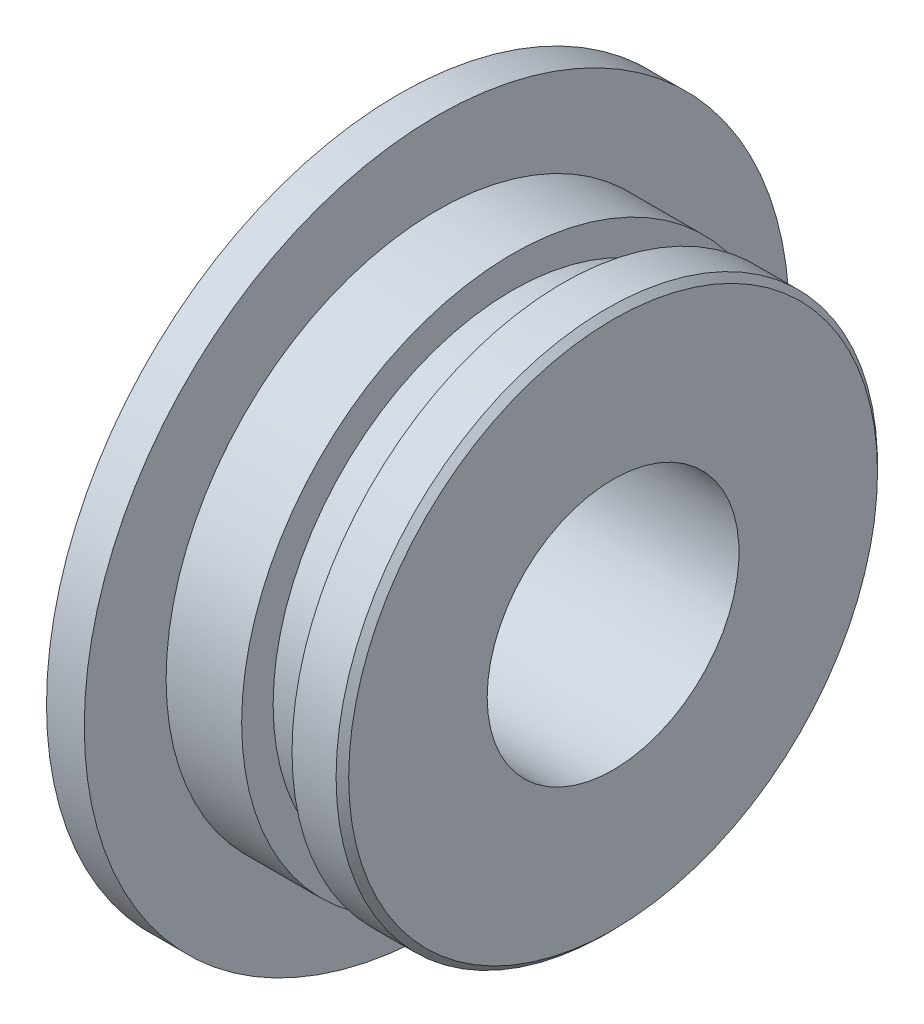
ISO-10303-21;
HEADER;
FILE_DESCRIPTION(('STEP AP214'),'2;1');
FILE_NAME('part.step','',(''),(''),'','','');
FILE_SCHEMA(('AUTOMOTIVE_DESIGN { 1 0 10303 214 1 1 1 1 }'));
ENDSEC;
DATA;
#1=APPLICATION_CONTEXT('core data for automotive mechanical design processes');
#2=APPLICATION_PROTOCOL_DEFINITION('international standard','automotive_design',2000,#1);
#3=PRODUCT_CONTEXT('',#1,'mechanical');
#4=PRODUCT('Part','Part','',(#3));
#5=PRODUCT_RELATED_PRODUCT_CATEGORY('part','',(#4));
#6=PRODUCT_DEFINITION_FORMATION('','',#4);
#7=PRODUCT_DEFINITION_CONTEXT('part definition',#1,'design');
#8=PRODUCT_DEFINITION('design','',#6,#7);
#9=PRODUCT_DEFINITION_SHAPE('','',#8);
#10=(LENGTH_UNIT() NAMED_UNIT(*) SI_UNIT(.MILLI.,.METRE.));
#11=(NAMED_UNIT(*) PLANE_ANGLE_UNIT() SI_UNIT($,.RADIAN.));
#12=(NAMED_UNIT(*) SI_UNIT($,.STERADIAN.) SOLID_ANGLE_UNIT());
#13=UNCERTAINTY_MEASURE_WITH_UNIT(LENGTH_MEASURE(1.E-05),#10,'distance_accuracy_value','');
#14=(GEOMETRIC_REPRESENTATION_CONTEXT(3) GLOBAL_UNCERTAINTY_ASSIGNED_CONTEXT((#13)) GLOBAL_UNIT_ASSIGNED_CONTEXT((#10,
#11,#12)) REPRESENTATION_CONTEXT('',''));
#15=CARTESIAN_POINT('',(0.,0.,0.));
#16=DIRECTION('',(0.,0.,1.));
#17=DIRECTION('',(1.,0.,0.));
#18=AXIS2_PLACEMENT_3D('',#15,#16,#17);
#19=CARTESIAN_POINT('',(0.,0.,0.));
#20=DIRECTION('',(-1.,0.,0.));
#21=DIRECTION('',(0.,0.,1.));
#22=AXIS2_PLACEMENT_3D('',#19,#20,#21);
#23=CYLINDRICAL_SURFACE('',#22,8.4);
#24=CARTESIAN_POINT('',(0.,0.,0.));
#25=DIRECTION('',(-1.,0.,0.));
#26=DIRECTION('',(0.,0.,1.));
#27=AXIS2_PLACEMENT_3D('',#24,#25,#26);
#28=CIRCLE('',#27,8.4);
#29=CARTESIAN_POINT('',(0.,0.,8.4));
#30=VERTEX_POINT('',#29);
#31=EDGE_CURVE('E40',#30,#30,#28,.T.);
#32=ORIENTED_EDGE('',*,*,#31,.F.);
#33=EDGE_LOOP('',(#32));
#34=FACE_BOUND('',#33,.T.);
#35=CARTESIAN_POINT('',(2.4,0.,0.));
#36=DIRECTION('',(-1.,0.,0.));
#37=DIRECTION('',(0.,0.,1.));
#38=AXIS2_PLACEMENT_3D('',#35,#36,#37);
#39=CIRCLE('',#38,8.4);
#40=CARTESIAN_POINT('',(2.4,0.,8.4));
#41=VERTEX_POINT('',#40);
#42=EDGE_CURVE('E73',#41,#41,#39,.T.);
#43=ORIENTED_EDGE('',*,*,#42,.T.);
#44=EDGE_LOOP('',(#43));
#45=FACE_BOUND('',#44,.T.);
#46=ADVANCED_FACE('F29',(#34,#45),#23,.T.);
#47=CARTESIAN_POINT('',(0.,5.,0.));
#48=DIRECTION('',(1.,0.,0.));
#49=DIRECTION('',(0.,0.,-1.));
#50=AXIS2_PLACEMENT_3D('',#47,#48,#49);
#51=PLANE('',#50);
#52=CARTESIAN_POINT('',(0.,0.,0.));
#53=DIRECTION('',(-1.,0.,0.));
#54=DIRECTION('',(0.,0.,1.));
#55=AXIS2_PLACEMENT_3D('',#52,#53,#54);
#56=CIRCLE('',#55,5.);
#57=CARTESIAN_POINT('',(0.,0.,5.));
#58=VERTEX_POINT('',#57);
#59=EDGE_CURVE('E44',#58,#58,#56,.T.);
#60=ORIENTED_EDGE('',*,*,#59,.F.);
#61=EDGE_LOOP('',(#60));
#62=FACE_BOUND('',#61,.T.);
#63=ORIENTED_EDGE('',*,*,#31,.T.);
#64=EDGE_LOOP('',(#63));
#65=FACE_BOUND('',#64,.T.);
#66=ADVANCED_FACE('F130',(#62,#65),#51,.F.);
#67=CARTESIAN_POINT('',(0.,0.,0.));
#68=DIRECTION('',(-1.,0.,0.));
#69=DIRECTION('',(0.,0.,1.));
#70=AXIS2_PLACEMENT_3D('',#67,#68,#69);
#71=CYLINDRICAL_SURFACE('',#70,5.);
#72=CARTESIAN_POINT('',(10.9,0.,0.));
#73=DIRECTION('',(-1.,0.,0.));
#74=DIRECTION('',(0.,0.,1.));
#75=AXIS2_PLACEMENT_3D('',#72,#73,#74);
#76=CIRCLE('',#75,5.);
#77=CARTESIAN_POINT('',(10.9,0.,5.));
#78=VERTEX_POINT('',#77);
#79=EDGE_CURVE('E49',#78,#78,#76,.T.);
#80=ORIENTED_EDGE('',*,*,#79,.F.);
#81=EDGE_LOOP('',(#80));
#82=FACE_BOUND('',#81,.T.);
#83=ORIENTED_EDGE('',*,*,#59,.T.);
#84=EDGE_LOOP('',(#83));
#85=FACE_BOUND('',#84,.T.);
#86=ADVANCED_FACE('F127',(#82,#85),#71,.F.);
#87=CARTESIAN_POINT('',(10.9,10.75,0.));
#88=DIRECTION('',(-1.,0.,0.));
#89=DIRECTION('',(0.,0.,1.));
#90=AXIS2_PLACEMENT_3D('',#87,#88,#89);
#91=PLANE('',#90);
#92=CARTESIAN_POINT('',(10.9,0.,0.));
#93=DIRECTION('',(-1.,0.,0.));
#94=DIRECTION('',(0.,0.,1.));
#95=AXIS2_PLACEMENT_3D('',#92,#93,#94);
#96=CIRCLE('',#95,10.5);
#97=CARTESIAN_POINT('',(10.9,0.,10.5));
#98=VERTEX_POINT('',#97);
#99=EDGE_CURVE('E10',#98,#98,#96,.F.);
#100=ORIENTED_EDGE('',*,*,#99,.T.);
#101=EDGE_LOOP('',(#100));
#102=FACE_BOUND('',#101,.T.);
#103=ORIENTED_EDGE('',*,*,#79,.T.);
#104=EDGE_LOOP('',(#103));
#105=FACE_BOUND('',#104,.T.);
#106=ADVANCED_FACE('F122',(#102,#105),#91,.F.);
#107=CARTESIAN_POINT('',(0.,0.,0.));
#108=DIRECTION('',(-1.,0.,0.));
#109=DIRECTION('',(0.,0.,1.));
#110=AXIS2_PLACEMENT_3D('',#107,#108,#109);
#111=CYLINDRICAL_SURFACE('',#110,10.75);
#112=CARTESIAN_POINT('',(10.65,0.,0.));
#113=DIRECTION('',(-1.,0.,0.));
#114=DIRECTION('',(0.,0.,1.));
#115=AXIS2_PLACEMENT_3D('',#112,#113,#114);
#116=CIRCLE('',#115,10.75);
#117=CARTESIAN_POINT('',(10.65,0.,10.75));
#118=VERTEX_POINT('',#117);
#119=EDGE_CURVE('E36',#118,#118,#116,.T.);
#120=ORIENTED_EDGE('',*,*,#119,.T.);
#121=EDGE_LOOP('',(#120));
#122=FACE_BOUND('',#121,.T.);
#123=CARTESIAN_POINT('',(8.9,0.,0.));
#124=DIRECTION('',(-1.,0.,0.));
#125=DIRECTION('',(0.,0.,1.));
#126=AXIS2_PLACEMENT_3D('',#123,#124,#125);
#127=CIRCLE('',#126,10.75);
#128=CARTESIAN_POINT('',(8.9,0.,10.75));
#129=VERTEX_POINT('',#128);
#130=EDGE_CURVE('E52',#129,#129,#127,.T.);
#131=ORIENTED_EDGE('',*,*,#130,.F.);
#132=EDGE_LOOP('',(#131));
#133=FACE_BOUND('',#132,.T.);
#134=ADVANCED_FACE('F117',(#122,#133),#111,.T.);
#135=CARTESIAN_POINT('',(8.9,9.50000000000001,0.));
#136=DIRECTION('',(1.,0.,0.));
#137=DIRECTION('',(0.,0.,-1.));
#138=AXIS2_PLACEMENT_3D('',#135,#136,#137);
#139=PLANE('',#138);
#140=CARTESIAN_POINT('',(8.9,0.,0.));
#141=DIRECTION('',(-1.,0.,0.));
#142=DIRECTION('',(0.,0.,1.));
#143=AXIS2_PLACEMENT_3D('',#140,#141,#142);
#144=CIRCLE('',#143,9.50000000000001);
#145=CARTESIAN_POINT('',(8.9,0.,9.50000000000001));
#146=VERTEX_POINT('',#145);
#147=EDGE_CURVE('E55',#146,#146,#144,.T.);
#148=ORIENTED_EDGE('',*,*,#147,.F.);
#149=EDGE_LOOP('',(#148));
#150=FACE_BOUND('',#149,.T.);
#151=ORIENTED_EDGE('',*,*,#130,.T.);
#152=EDGE_LOOP('',(#151));
#153=FACE_BOUND('',#152,.T.);
#154=ADVANCED_FACE('F111',(#150,#153),#139,.F.);
#155=CARTESIAN_POINT('',(0.,0.,0.));
#156=DIRECTION('',(-1.,0.,0.));
#157=DIRECTION('',(0.,0.,1.));
#158=AXIS2_PLACEMENT_3D('',#155,#156,#157);
#159=CYLINDRICAL_SURFACE('',#158,9.50000000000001);
#160=CARTESIAN_POINT('',(6.9,0.,0.));
#161=DIRECTION('',(-1.,0.,0.));
#162=DIRECTION('',(0.,0.,1.));
#163=AXIS2_PLACEMENT_3D('',#160,#161,#162);
#164=CIRCLE('',#163,9.50000000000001);
#165=CARTESIAN_POINT('',(6.9,0.,9.50000000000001));
#166=VERTEX_POINT('',#165);
#167=EDGE_CURVE('E58',#166,#166,#164,.T.);
#168=ORIENTED_EDGE('',*,*,#167,.F.);
#169=EDGE_LOOP('',(#168));
#170=FACE_BOUND('',#169,.T.);
#171=ORIENTED_EDGE('',*,*,#147,.T.);
#172=EDGE_LOOP('',(#171));
#173=FACE_BOUND('',#172,.T.);
#174=ADVANCED_FACE('F105',(#170,#173),#159,.T.);
#175=CARTESIAN_POINT('',(6.9,10.75,0.));
#176=DIRECTION('',(-1.,0.,0.));
#177=DIRECTION('',(0.,0.,1.));
#178=AXIS2_PLACEMENT_3D('',#175,#176,#177);
#179=PLANE('',#178);
#180=CARTESIAN_POINT('',(6.9,0.,0.));
#181=DIRECTION('',(-1.,0.,0.));
#182=DIRECTION('',(0.,0.,1.));
#183=AXIS2_PLACEMENT_3D('',#180,#181,#182);
#184=CIRCLE('',#183,10.75);
#185=CARTESIAN_POINT('',(6.9,0.,10.75));
#186=VERTEX_POINT('',#185);
#187=EDGE_CURVE('E61',#186,#186,#184,.T.);
#188=ORIENTED_EDGE('',*,*,#187,.F.);
#189=EDGE_LOOP('',(#188));
#190=FACE_BOUND('',#189,.T.);
#191=ORIENTED_EDGE('',*,*,#167,.T.);
#192=EDGE_LOOP('',(#191));
#193=FACE_BOUND('',#192,.T.);
#194=ADVANCED_FACE('F99',(#190,#193),#179,.F.);
#195=CARTESIAN_POINT('',(0.,0.,0.));
#196=DIRECTION('',(-1.,0.,0.));
#197=DIRECTION('',(0.,0.,1.));
#198=AXIS2_PLACEMENT_3D('',#195,#196,#197);
#199=CYLINDRICAL_SURFACE('',#198,10.75);
#200=CARTESIAN_POINT('',(3.9,0.,0.));
#201=DIRECTION('',(-1.,0.,0.));
#202=DIRECTION('',(0.,0.,1.));
#203=AXIS2_PLACEMENT_3D('',#200,#201,#202);
#204=CIRCLE('',#203,10.75);
#205=CARTESIAN_POINT('',(3.9,0.,10.75));
#206=VERTEX_POINT('',#205);
#207=EDGE_CURVE('E64',#206,#206,#204,.T.);
#208=ORIENTED_EDGE('',*,*,#207,.F.);
#209=EDGE_LOOP('',(#208));
#210=FACE_BOUND('',#209,.T.);
#211=ORIENTED_EDGE('',*,*,#187,.T.);
#212=EDGE_LOOP('',(#211));
#213=FACE_BOUND('',#212,.T.);
#214=ADVANCED_FACE('F93',(#210,#213),#199,.T.);
#215=CARTESIAN_POINT('',(3.9,14.,0.));
#216=DIRECTION('',(-1.,0.,0.));
#217=DIRECTION('',(0.,0.,1.));
#218=AXIS2_PLACEMENT_3D('',#215,#216,#217);
#219=PLANE('',#218);
#220=CARTESIAN_POINT('',(3.9,0.,0.));
#221=DIRECTION('',(-1.,0.,0.));
#222=DIRECTION('',(0.,0.,1.));
#223=AXIS2_PLACEMENT_3D('',#220,#221,#222);
#224=CIRCLE('',#223,14.);
#225=CARTESIAN_POINT('',(3.9,0.,14.));
#226=VERTEX_POINT('',#225);
#227=EDGE_CURVE('E67',#226,#226,#224,.T.);
#228=ORIENTED_EDGE('',*,*,#227,.F.);
#229=EDGE_LOOP('',(#228));
#230=FACE_BOUND('',#229,.T.);
#231=ORIENTED_EDGE('',*,*,#207,.T.);
#232=EDGE_LOOP('',(#231));
#233=FACE_BOUND('',#232,.T.);
#234=ADVANCED_FACE('F87',(#230,#233),#219,.F.);
#235=CARTESIAN_POINT('',(0.,0.,0.));
#236=DIRECTION('',(-1.,0.,0.));
#237=DIRECTION('',(0.,0.,1.));
#238=AXIS2_PLACEMENT_3D('',#235,#236,#237);
#239=CYLINDRICAL_SURFACE('',#238,14.);
#240=CARTESIAN_POINT('',(2.4,0.,0.));
#241=DIRECTION('',(-1.,0.,0.));
#242=DIRECTION('',(0.,0.,1.));
#243=AXIS2_PLACEMENT_3D('',#240,#241,#242);
#244=CIRCLE('',#243,14.);
#245=CARTESIAN_POINT('',(2.4,0.,14.));
#246=VERTEX_POINT('',#245);
#247=EDGE_CURVE('E70',#246,#246,#244,.T.);
#248=ORIENTED_EDGE('',*,*,#247,.F.);
#249=EDGE_LOOP('',(#248));
#250=FACE_BOUND('',#249,.T.);
#251=ORIENTED_EDGE('',*,*,#227,.T.);
#252=EDGE_LOOP('',(#251));
#253=FACE_BOUND('',#252,.T.);
#254=ADVANCED_FACE('F81',(#250,#253),#239,.T.);
#255=CARTESIAN_POINT('',(2.4,8.4,0.));
#256=DIRECTION('',(1.,0.,0.));
#257=DIRECTION('',(0.,0.,-1.));
#258=AXIS2_PLACEMENT_3D('',#255,#256,#257);
#259=PLANE('',#258);
#260=ORIENTED_EDGE('',*,*,#42,.F.);
#261=EDGE_LOOP('',(#260));
#262=FACE_BOUND('',#261,.T.);
#263=ORIENTED_EDGE('',*,*,#247,.T.);
#264=EDGE_LOOP('',(#263));
#265=FACE_BOUND('',#264,.T.);
#266=ADVANCED_FACE('F78',(#262,#265),#259,.F.);
#267=CARTESIAN_POINT('',(10.65,0.,0.));
#268=DIRECTION('',(-1.,0.,0.));
#269=DIRECTION('',(0.,0.,1.));
#270=AXIS2_PLACEMENT_3D('',#267,#268,#269);
#271=CONICAL_SURFACE('',#270,10.75,0.785398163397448);
#272=ORIENTED_EDGE('',*,*,#99,.F.);
#273=EDGE_LOOP('',(#272));
#274=FACE_BOUND('',#273,.T.);
#275=ORIENTED_EDGE('',*,*,#119,.F.);
#276=EDGE_LOOP('',(#275));
#277=FACE_BOUND('',#276,.T.);
#278=ADVANCED_FACE('F31',(#274,#277),#271,.T.);
#279=CLOSED_SHELL('',(#46,#66,#86,#106,#134,#154,#174,#194,#214,#234,#254,#266,#278));
#280=MANIFOLD_SOLID_BREP('B2',#279);
#281=ADVANCED_BREP_SHAPE_REPRESENTATION('',(#18,#280),#14);
#282=SHAPE_DEFINITION_REPRESENTATION(#9,#281);
ENDSEC;
END-ISO-10303-21;
